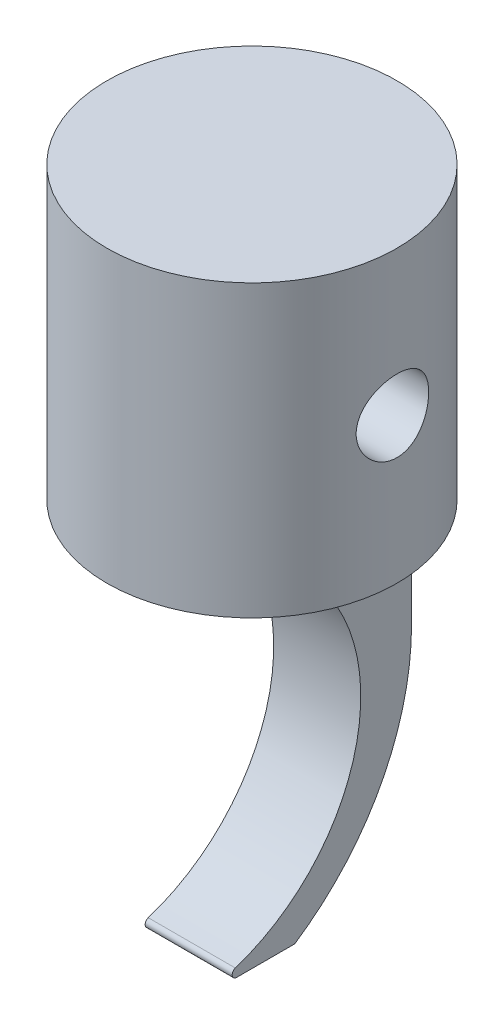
ISO-10303-21;
HEADER;
FILE_DESCRIPTION(('STEP AP214'),'2;1');
FILE_NAME('part.step','',(''),(''),'','','');
FILE_SCHEMA(('AUTOMOTIVE_DESIGN { 1 0 10303 214 1 1 1 1 }'));
ENDSEC;
DATA;
#1=APPLICATION_CONTEXT('core data for automotive mechanical design processes');
#2=APPLICATION_PROTOCOL_DEFINITION('international standard','automotive_design',2000,#1);
#3=PRODUCT_CONTEXT('',#1,'mechanical');
#4=PRODUCT('Part','Part','',(#3));
#5=PRODUCT_RELATED_PRODUCT_CATEGORY('part','',(#4));
#6=PRODUCT_DEFINITION_FORMATION('','',#4);
#7=PRODUCT_DEFINITION_CONTEXT('part definition',#1,'design');
#8=PRODUCT_DEFINITION('design','',#6,#7);
#9=PRODUCT_DEFINITION_SHAPE('','',#8);
#10=(LENGTH_UNIT() NAMED_UNIT(*) SI_UNIT(.MILLI.,.METRE.));
#11=(NAMED_UNIT(*) PLANE_ANGLE_UNIT() SI_UNIT($,.RADIAN.));
#12=(NAMED_UNIT(*) SI_UNIT($,.STERADIAN.) SOLID_ANGLE_UNIT());
#13=UNCERTAINTY_MEASURE_WITH_UNIT(LENGTH_MEASURE(1.E-05),#10,'distance_accuracy_value','');
#14=(GEOMETRIC_REPRESENTATION_CONTEXT(3) GLOBAL_UNCERTAINTY_ASSIGNED_CONTEXT((#13)) GLOBAL_UNIT_ASSIGNED_CONTEXT((#10,
#11,#12)) REPRESENTATION_CONTEXT('',''));
#15=CARTESIAN_POINT('',(0.,0.,0.));
#16=DIRECTION('',(0.,0.,1.));
#17=DIRECTION('',(1.,0.,0.));
#18=AXIS2_PLACEMENT_3D('',#15,#16,#17);
#19=CARTESIAN_POINT('',(0.,20.,0.));
#20=DIRECTION('',(0.,-1.,0.));
#21=DIRECTION('',(0.,0.,-1.));
#22=AXIS2_PLACEMENT_3D('',#19,#20,#21);
#23=CYLINDRICAL_SURFACE('',#22,10.);
#24=CARTESIAN_POINT('',(-10.,7.5,0.));
#25=CARTESIAN_POINT('',(-9.99999766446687,7.50000387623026,-0.138126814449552));
#26=CARTESIAN_POINT('',(-9.99710963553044,7.51148591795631,-0.276296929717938));
#27=CARTESIAN_POINT('',(-9.98586856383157,7.55704191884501,-0.548677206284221));
#28=CARTESIAN_POINT('',(-9.97751242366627,7.59112868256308,-0.682885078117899));
#29=CARTESIAN_POINT('',(-9.9562604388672,7.68073208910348,-0.943368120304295));
#30=CARTESIAN_POINT('',(-9.94337004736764,7.73622299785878,-1.06965260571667));
#31=CARTESIAN_POINT('',(-9.91442239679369,7.86696898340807,-1.31112021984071));
#32=CARTESIAN_POINT('',(-9.89836503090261,7.94222472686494,-1.42630297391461));
#33=CARTESIAN_POINT('',(-9.86445689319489,8.1120013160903,-1.64466987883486));
#34=CARTESIAN_POINT('',(-9.84657845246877,8.20685262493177,-1.74759281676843));
#35=CARTESIAN_POINT('',(-9.8112270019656,8.41242034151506,-1.93624821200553));
#36=CARTESIAN_POINT('',(-9.79375403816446,8.52313853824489,-2.02197872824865));
#37=CARTESIAN_POINT('',(-9.76091292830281,8.75932537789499,-2.17504423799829));
#38=CARTESIAN_POINT('',(-9.74557990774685,8.88498871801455,-2.2420870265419));
#39=CARTESIAN_POINT('',(-9.71915824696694,9.14624735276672,-2.35399484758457));
#40=CARTESIAN_POINT('',(-9.70806892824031,9.28184105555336,-2.39886342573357));
#41=CARTESIAN_POINT('',(-9.69167461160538,9.55623916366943,-2.46425806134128));
#42=CARTESIAN_POINT('',(-9.68625818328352,9.69492482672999,-2.48525378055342));
#43=CARTESIAN_POINT('',(-9.68148937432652,9.97394761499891,-2.50376962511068));
#44=CARTESIAN_POINT('',(-9.68213600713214,10.1142844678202,-2.50129356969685));
#45=CARTESIAN_POINT('',(-9.68932009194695,10.3890263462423,-2.47331087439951));
#46=CARTESIAN_POINT('',(-9.69571438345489,10.5234927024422,-2.44836390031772));
#47=CARTESIAN_POINT('',(-9.71344516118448,10.7862684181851,-2.37704031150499));
#48=CARTESIAN_POINT('',(-9.72478199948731,10.9145773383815,-2.33066217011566));
#49=CARTESIAN_POINT('',(-9.75125189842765,11.1628966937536,-2.21731579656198));
#50=CARTESIAN_POINT('',(-9.76642212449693,11.282810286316,-2.1501444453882));
#51=CARTESIAN_POINT('',(-9.79882851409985,11.5098645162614,-1.99726046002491));
#52=CARTESIAN_POINT('',(-9.81606503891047,11.6170029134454,-1.91154458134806));
#53=CARTESIAN_POINT('',(-9.85126467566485,11.818672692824,-1.72110570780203));
#54=CARTESIAN_POINT('',(-9.86923449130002,11.9127574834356,-1.61591043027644));
#55=CARTESIAN_POINT('',(-9.90343275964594,12.0820354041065,-1.39101986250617));
#56=CARTESIAN_POINT('',(-9.91966115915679,12.1572279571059,-1.27132412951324));
#57=CARTESIAN_POINT('',(-9.94862886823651,12.2867509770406,-1.02019314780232));
#58=CARTESIAN_POINT('',(-9.96135600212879,12.341008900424,-0.888718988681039));
#59=CARTESIAN_POINT('',(-9.98179861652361,12.4265288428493,-0.618126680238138));
#60=CARTESIAN_POINT('',(-9.98951505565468,12.4577952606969,-0.479009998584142));
#61=CARTESIAN_POINT('',(-9.99892498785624,12.4957626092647,-0.200899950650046));
#62=CARTESIAN_POINT('',(-10.0007675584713,12.5030717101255,-0.0619945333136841));
#63=CARTESIAN_POINT('',(-9.99864674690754,12.4945849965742,0.215054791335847));
#64=CARTESIAN_POINT('',(-9.99468388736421,12.4787912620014,0.353198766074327));
#65=CARTESIAN_POINT('',(-9.98149301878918,12.4250484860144,0.622690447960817));
#66=CARTESIAN_POINT('',(-9.97234390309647,12.3874312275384,0.754108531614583));
#67=CARTESIAN_POINT('',(-9.94981177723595,12.2914881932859,1.00876215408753));
#68=CARTESIAN_POINT('',(-9.93642833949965,12.2331603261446,1.13199686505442));
#69=CARTESIAN_POINT('',(-9.9065551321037,12.0962731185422,1.36920522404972));
#70=CARTESIAN_POINT('',(-9.89001445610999,12.0173731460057,1.48297573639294));
#71=CARTESIAN_POINT('',(-9.85574181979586,11.8420168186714,1.69587768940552));
#72=CARTESIAN_POINT('',(-9.83800965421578,11.7455574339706,1.79500659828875));
#73=CARTESIAN_POINT('',(-9.80281594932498,11.5349967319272,1.97831761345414));
#74=CARTESIAN_POINT('',(-9.78537173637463,11.4205204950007,2.06207311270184));
#75=CARTESIAN_POINT('',(-9.75321463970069,11.1787789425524,2.20918459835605));
#76=CARTESIAN_POINT('',(-9.73850163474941,11.0515141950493,2.27254149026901));
#77=CARTESIAN_POINT('',(-9.71363491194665,10.7884904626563,2.37658570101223));
#78=CARTESIAN_POINT('',(-9.70345425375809,10.6527872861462,2.41740732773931));
#79=CARTESIAN_POINT('',(-9.68877906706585,10.3761506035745,2.47557609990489));
#80=CARTESIAN_POINT('',(-9.68428329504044,10.2352182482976,2.49292837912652));
#81=CARTESIAN_POINT('',(-9.68158168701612,9.95646496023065,2.50339765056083));
#82=CARTESIAN_POINT('',(-9.68319887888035,9.81867094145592,2.49719649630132));
#83=CARTESIAN_POINT('',(-9.69213181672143,9.54616018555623,2.46229546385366));
#84=CARTESIAN_POINT('',(-9.69944744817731,9.41144338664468,2.43359603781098));
#85=CARTESIAN_POINT('',(-9.71885434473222,9.14965256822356,2.35488553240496));
#86=CARTESIAN_POINT('',(-9.73091692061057,9.02253782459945,2.30500234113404));
#87=CARTESIAN_POINT('',(-9.7584625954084,8.77839102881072,2.18544152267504));
#88=CARTESIAN_POINT('',(-9.77394616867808,8.66136037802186,2.11576115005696));
#89=CARTESIAN_POINT('',(-9.80709390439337,8.43740895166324,1.95644624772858));
#90=CARTESIAN_POINT('',(-9.82480441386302,8.33083154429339,1.86633860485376));
#91=CARTESIAN_POINT('',(-9.86013378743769,8.13408825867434,1.66964895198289));
#92=CARTESIAN_POINT('',(-9.87775262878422,8.04392628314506,1.56306303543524));
#93=CARTESIAN_POINT('',(-9.9112942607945,7.88098115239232,1.33411264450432));
#94=CARTESIAN_POINT('',(-9.92718055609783,7.80854231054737,1.21149737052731));
#95=CARTESIAN_POINT('',(-9.95508208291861,7.68542089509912,0.95544343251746));
#96=CARTESIAN_POINT('',(-9.96710008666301,7.63472273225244,0.8220126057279));
#97=CARTESIAN_POINT('',(-9.98413432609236,7.56404694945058,0.574017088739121));
#98=CARTESIAN_POINT('',(-9.99004308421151,7.54008126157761,0.460633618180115));
#99=CARTESIAN_POINT('',(-9.9979767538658,7.5080567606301,0.231510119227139));
#100=CARTESIAN_POINT('',(-10.0000019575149,7.49999675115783,0.115770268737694));
#101=CARTESIAN_POINT('',(-10.,7.5,0.));
#102=B_SPLINE_CURVE_WITH_KNOTS('',3,(#24,#25,#26,#27,#28,#29,#30,#31,#32,#33,#34,#35,#36,#37,
#38,#39,#40,#41,#42,#43,#44,#45,#46,#47,#48,#49,#50,#51,#52,#53,#54,#55,#56,#57,#58,#59,#60,#61,
#62,#63,#64,#65,#66,#67,#68,#69,#70,#71,#72,#73,#74,#75,#76,#77,#78,#79,#80,#81,#82,#83,#84,#85,
#86,#87,#88,#89,#90,#91,#92,#93,#94,#95,#96,#97,#98,#99,#100,#101),.UNSPECIFIED.,.T.,.F.,(4,2,2,
2,2,2,2,2,2,2,2,2,2,2,2,2,2,2,2,2,2,2,2,2,2,2,2,2,2,2,2,2,2,2,2,2,2,2,4),(0.,0.413956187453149,
0.828147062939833,1.24184150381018,1.65554990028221,2.07690725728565,2.4983121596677,
2.92597745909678,3.35357435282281,3.77260491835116,4.19156730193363,4.60037495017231,
5.00921172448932,5.42217546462,5.83521151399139,6.26002501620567,6.6848514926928,
7.11113715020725,7.53734122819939,7.95263848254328,8.36789835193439,8.7770045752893,
9.18615212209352,9.60255979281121,10.0190393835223,10.4457418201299,10.8724253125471,
11.2965375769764,11.7205570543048,12.1323963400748,12.5442273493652,12.9536066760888,
13.3630428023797,13.7831596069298,14.2033761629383,14.6312030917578,15.0587227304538,
15.4057040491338,15.752659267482),.UNSPECIFIED.);
#103=CARTESIAN_POINT('',(-10.,7.5,0.));
#104=VERTEX_POINT('',#103);
#105=EDGE_CURVE('E11',#104,#104,#102,.T.);
#106=ORIENTED_EDGE('',*,*,#105,.T.);
#107=EDGE_LOOP('',(#106));
#108=FACE_BOUND('',#107,.T.);
#109=CARTESIAN_POINT('',(9.68245836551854,10.,-2.5));
#110=CARTESIAN_POINT('',(9.6824610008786,9.86194924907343,-2.49999607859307));
#111=CARTESIAN_POINT('',(9.68544306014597,9.72385510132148,-2.48852624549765));
#112=CARTESIAN_POINT('',(9.69701861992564,9.45163242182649,-2.44302312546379));
#113=CARTESIAN_POINT('',(9.7056153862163,9.31750624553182,-2.40897670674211));
#114=CARTESIAN_POINT('',(9.7273872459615,9.05719646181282,-2.31949119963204));
#115=CARTESIAN_POINT('',(9.74055642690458,8.93100284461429,-2.26407972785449));
#116=CARTESIAN_POINT('',(9.76998192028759,8.68968914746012,-2.13352114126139));
#117=CARTESIAN_POINT('',(9.78623836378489,8.57456953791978,-2.05837318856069));
#118=CARTESIAN_POINT('',(9.82040716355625,8.35613835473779,-1.88870842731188));
#119=CARTESIAN_POINT('',(9.83834597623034,8.25310639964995,-1.79383688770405));
#120=CARTESIAN_POINT('',(9.87362875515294,8.06423860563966,-1.58818206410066));
#121=CARTESIAN_POINT('',(9.89097266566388,7.97840437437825,-1.47739729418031));
#122=CARTESIAN_POINT('',(9.92340415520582,7.82522453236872,-1.24114520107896));
#123=CARTESIAN_POINT('',(9.93845687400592,7.75815361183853,-1.11549457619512));
#124=CARTESIAN_POINT('',(9.96430811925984,7.64619035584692,-0.854263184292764));
#125=CARTESIAN_POINT('',(9.97510727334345,7.60129474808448,-0.718683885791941));
#126=CARTESIAN_POINT('',(9.9910475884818,7.53585216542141,-0.444358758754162));
#127=CARTESIAN_POINT('',(9.99629893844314,7.51483035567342,-0.305732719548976));
#128=CARTESIAN_POINT('',(10.000935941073,7.49624162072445,-0.02682881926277));
#129=CARTESIAN_POINT('',(10.000322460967,7.4986712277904,0.113448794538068));
#130=CARTESIAN_POINT('',(9.99338094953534,7.52657485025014,0.388380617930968));
#131=CARTESIAN_POINT('',(9.98718002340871,7.55153632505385,0.523090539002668));
#132=CARTESIAN_POINT('',(9.96990836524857,7.6229712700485,0.786345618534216));
#133=CARTESIAN_POINT('',(9.95883737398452,7.66944588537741,0.914890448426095));
#134=CARTESIAN_POINT('',(9.93287509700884,7.78300257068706,1.16351675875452));
#135=CARTESIAN_POINT('',(9.91795019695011,7.85026704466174,1.28351127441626));
#136=CARTESIAN_POINT('',(9.88589903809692,8.00335567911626,1.51068905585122));
#137=CARTESIAN_POINT('',(9.8687723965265,8.08918306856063,1.61787008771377));
#138=CARTESIAN_POINT('',(9.83363713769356,8.27970874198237,1.81943508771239));
#139=CARTESIAN_POINT('',(9.81561719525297,8.38485489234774,1.91339419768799));
#140=CARTESIAN_POINT('',(9.78115043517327,8.60959997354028,2.08244093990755));
#141=CARTESIAN_POINT('',(9.76470369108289,8.72919957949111,2.15752769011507));
#142=CARTESIAN_POINT('',(9.73520496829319,8.98029003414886,2.28697032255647));
#143=CARTESIAN_POINT('',(9.72216983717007,9.1118357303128,2.34122391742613));
#144=CARTESIAN_POINT('',(9.70118640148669,9.38258546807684,2.42671405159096));
#145=CARTESIAN_POINT('',(9.69323700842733,9.5217878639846,2.45795551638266));
#146=CARTESIAN_POINT('',(9.68355356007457,9.79995950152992,2.49582963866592));
#147=CARTESIAN_POINT('',(9.68166088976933,9.93883779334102,2.50309047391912));
#148=CARTESIAN_POINT('',(9.68387343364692,10.2158219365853,2.49451699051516));
#149=CARTESIAN_POINT('',(9.687978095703,10.3539278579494,2.4786847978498));
#150=CARTESIAN_POINT('',(9.70157081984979,10.6231142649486,2.42492546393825));
#151=CARTESIAN_POINT('',(9.71096970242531,10.7542727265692,2.3873640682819));
#152=CARTESIAN_POINT('',(9.73400718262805,11.0084314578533,2.29161808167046));
#153=CARTESIAN_POINT('',(9.74764628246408,11.1314307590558,2.2334310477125));
#154=CARTESIAN_POINT('',(9.77796137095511,11.3684412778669,2.0967706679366));
#155=CARTESIAN_POINT('',(9.79469168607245,11.482228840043,2.01792175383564));
#156=CARTESIAN_POINT('',(9.82917083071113,11.6951883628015,1.84265073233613));
#157=CARTESIAN_POINT('',(9.84691982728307,11.7943579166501,1.7462257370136));
#158=CARTESIAN_POINT('',(9.88197403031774,11.9778110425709,1.53565680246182));
#159=CARTESIAN_POINT('',(9.8992570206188,12.0616600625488,1.42112988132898));
#160=CARTESIAN_POINT('',(9.93097216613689,12.2089358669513,1.17925670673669));
#161=CARTESIAN_POINT('',(9.94540447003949,12.2723637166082,1.05191112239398));
#162=CARTESIAN_POINT('',(9.96970115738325,12.3764460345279,0.788895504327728));
#163=CARTESIAN_POINT('',(9.97959830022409,12.4172642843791,0.653293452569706));
#164=CARTESIAN_POINT('',(9.99385293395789,12.4754603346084,0.376874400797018));
#165=CARTESIAN_POINT('',(9.99821149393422,12.492842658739,0.236058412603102));
#166=CARTESIAN_POINT('',(10.0008542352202,12.5034189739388,-0.0427088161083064));
#167=CARTESIAN_POINT('',(9.99929947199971,12.4972542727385,-0.180634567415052));
#168=CARTESIAN_POINT('',(9.99064741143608,12.4623804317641,-0.453418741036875));
#169=CARTESIAN_POINT('',(9.98355027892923,12.4336719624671,-0.58827725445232));
#170=CARTESIAN_POINT('',(9.96463582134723,12.3548694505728,-0.850427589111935));
#171=CARTESIAN_POINT('',(9.95284411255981,12.3048913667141,-0.977756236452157));
#172=CARTESIAN_POINT('',(9.92578222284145,12.1850735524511,-1.22229263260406));
#173=CARTESIAN_POINT('',(9.91051160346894,12.1152313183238,-1.33949910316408));
#174=CARTESIAN_POINT('',(9.87768124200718,11.9557119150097,-1.56350482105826));
#175=CARTESIAN_POINT('',(9.86007542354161,11.8655996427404,-1.66998747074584));
#176=CARTESIAN_POINT('',(9.82476622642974,11.6689428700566,-1.86653755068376));
#177=CARTESIAN_POINT('',(9.80706282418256,11.5623942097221,-1.95660081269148));
#178=CARTESIAN_POINT('',(9.77318689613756,11.3334964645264,-2.11940506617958));
#179=CARTESIAN_POINT('',(9.75704909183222,11.2108896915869,-2.19179154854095));
#180=CARTESIAN_POINT('',(9.7285988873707,10.954861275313,-2.31481724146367));
#181=CARTESIAN_POINT('',(9.71628370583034,10.8214475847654,-2.36547227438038));
#182=CARTESIAN_POINT('',(9.69879771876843,10.5735574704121,-2.43605632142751));
#183=CARTESIAN_POINT('',(9.69271657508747,10.4602670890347,-2.4599829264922));
#184=CARTESIAN_POINT('',(9.6845459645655,10.2313278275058,-2.49195573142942));
#185=CARTESIAN_POINT('',(9.6824561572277,10.115679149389,-2.50000328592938));
#186=CARTESIAN_POINT('',(9.68245836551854,10.,-2.5));
#187=B_SPLINE_CURVE_WITH_KNOTS('',3,(#109,#110,#111,#112,#113,#114,#115,#116,#117,#118,#119,
#120,#121,#122,#123,#124,#125,#126,#127,#128,#129,#130,#131,#132,#133,#134,#135,#136,#137,#138,
#139,#140,#141,#142,#143,#144,#145,#146,#147,#148,#149,#150,#151,#152,#153,#154,#155,#156,#157,
#158,#159,#160,#161,#162,#163,#164,#165,#166,#167,#168,#169,#170,#171,#172,#173,#174,#175,#176,
#177,#178,#179,#180,#181,#182,#183,#184,#185,#186),.UNSPECIFIED.,.T.,.F.,(4,2,2,2,2,2,2,2,2,2,2,
2,2,2,2,2,2,2,2,2,2,2,2,2,2,2,2,2,2,2,2,2,2,2,2,2,2,2,4),(0.,0.413727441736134,
0.827695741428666,1.24113072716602,1.65458326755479,2.07623954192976,2.49793521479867,
2.9255149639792,3.35303159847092,3.77188750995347,4.19068148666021,4.60018262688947,
5.00970556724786,5.42292874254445,5.83622385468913,6.26070466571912,6.68520531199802,
7.11176432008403,7.53823200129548,7.95343574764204,8.36860127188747,8.77697405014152,
9.18539521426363,9.60182845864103,10.0183301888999,10.4452533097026,10.872154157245,
11.2959207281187,11.7196054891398,12.131834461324,12.5440511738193,12.9540487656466,
13.3640980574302,13.7839709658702,14.2039503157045,14.6317647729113,15.0592672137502,
15.4059782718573,15.7526597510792),.UNSPECIFIED.);
#188=CARTESIAN_POINT('',(9.68245836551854,10.,-2.5));
#189=VERTEX_POINT('',#188);
#190=EDGE_CURVE('E60',#189,#189,#187,.T.);
#191=ORIENTED_EDGE('',*,*,#190,.T.);
#192=EDGE_LOOP('',(#191));
#193=FACE_BOUND('',#192,.T.);
#194=CARTESIAN_POINT('',(0.,20.,0.));
#195=DIRECTION('',(0.,1.,0.));
#196=DIRECTION('',(0.,0.,1.));
#197=AXIS2_PLACEMENT_3D('',#194,#195,#196);
#198=CIRCLE('',#197,10.);
#199=CARTESIAN_POINT('',(0.,20.,10.));
#200=VERTEX_POINT('',#199);
#201=EDGE_CURVE('E177',#200,#200,#198,.T.);
#202=ORIENTED_EDGE('',*,*,#201,.F.);
#203=EDGE_LOOP('',(#202));
#204=FACE_BOUND('',#203,.T.);
#205=CARTESIAN_POINT('',(0.,0.,0.));
#206=DIRECTION('',(0.,1.,0.));
#207=DIRECTION('',(0.,0.,1.));
#208=AXIS2_PLACEMENT_3D('',#205,#206,#207);
#209=CIRCLE('',#208,10.);
#210=CARTESIAN_POINT('',(0.,0.,10.));
#211=VERTEX_POINT('',#210);
#212=EDGE_CURVE('E166',#211,#211,#209,.T.);
#213=ORIENTED_EDGE('',*,*,#212,.T.);
#214=EDGE_LOOP('',(#213));
#215=FACE_BOUND('',#214,.T.);
#216=ADVANCED_FACE('F47',(#108,#193,#204,#215),#23,.T.);
#217=CARTESIAN_POINT('',(0.,20.,0.));
#218=DIRECTION('',(0.,1.,0.));
#219=DIRECTION('',(0.,0.,1.));
#220=AXIS2_PLACEMENT_3D('',#217,#218,#219);
#221=PLANE('',#220);
#222=ORIENTED_EDGE('',*,*,#201,.T.);
#223=EDGE_LOOP('',(#222));
#224=FACE_BOUND('',#223,.T.);
#225=ADVANCED_FACE('F217',(#224),#221,.T.);
#226=CARTESIAN_POINT('',(0.,0.,0.));
#227=DIRECTION('',(0.,1.,0.));
#228=DIRECTION('',(0.,0.,1.));
#229=AXIS2_PLACEMENT_3D('',#226,#227,#228);
#230=PLANE('',#229);
#231=DIRECTION('',(1.,0.,0.));
#232=VECTOR('',#231,1.);
#233=CARTESIAN_POINT('',(-3.,0.,-8.));
#234=LINE('',#233,#232);
#235=CARTESIAN_POINT('',(-3.,0.,-8.));
#236=VERTEX_POINT('',#235);
#237=CARTESIAN_POINT('',(3.,0.,-8.));
#238=VERTEX_POINT('',#237);
#239=EDGE_CURVE('E72',#236,#238,#234,.T.);
#240=ORIENTED_EDGE('',*,*,#239,.F.);
#241=DIRECTION('',(0.,0.,1.));
#242=VECTOR('',#241,1.);
#243=CARTESIAN_POINT('',(-3.,0.,8.));
#244=LINE('',#243,#242);
#245=CARTESIAN_POINT('',(-3.,0.,8.));
#246=VERTEX_POINT('',#245);
#247=EDGE_CURVE('E67',#236,#246,#244,.T.);
#248=ORIENTED_EDGE('',*,*,#247,.T.);
#249=DIRECTION('',(1.,0.,0.));
#250=VECTOR('',#249,1.);
#251=CARTESIAN_POINT('',(-3.,0.,8.));
#252=LINE('',#251,#250);
#253=CARTESIAN_POINT('',(3.,0.,8.));
#254=VERTEX_POINT('',#253);
#255=EDGE_CURVE('E163',#246,#254,#252,.T.);
#256=ORIENTED_EDGE('',*,*,#255,.T.);
#257=DIRECTION('',(0.,0.,1.));
#258=VECTOR('',#257,1.);
#259=CARTESIAN_POINT('',(3.,0.,8.));
#260=LINE('',#259,#258);
#261=EDGE_CURVE('E129',#238,#254,#260,.T.);
#262=ORIENTED_EDGE('',*,*,#261,.F.);
#263=EDGE_LOOP('',(#240,#248,#256,#262));
#264=FACE_BOUND('',#263,.T.);
#265=ORIENTED_EDGE('',*,*,#212,.F.);
#266=EDGE_LOOP('',(#265));
#267=FACE_BOUND('',#266,.T.);
#268=ADVANCED_FACE('F216',(#264,#267),#230,.F.);
#269=CARTESIAN_POINT('',(-3.,-12.5,8.));
#270=DIRECTION('',(1.,0.,0.));
#271=DIRECTION('',(0.,0.,-1.));
#272=AXIS2_PLACEMENT_3D('',#269,#270,#271);
#273=CYLINDRICAL_SURFACE('',#272,12.5);
#274=DIRECTION('',(1.,0.,0.));
#275=VECTOR('',#274,1.);
#276=CARTESIAN_POINT('',(-3.,-24.3911383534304,4.14632270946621));
#277=LINE('',#276,#275);
#278=CARTESIAN_POINT('',(-3.,-24.3911383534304,4.14632270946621));
#279=VERTEX_POINT('',#278);
#280=CARTESIAN_POINT('',(3.,-24.3911383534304,4.14632270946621));
#281=VERTEX_POINT('',#280);
#282=EDGE_CURVE('E104',#279,#281,#277,.T.);
#283=ORIENTED_EDGE('',*,*,#282,.T.);
#284=CARTESIAN_POINT('',(3.,-12.5,8.));
#285=DIRECTION('',(-1.,0.,0.));
#286=DIRECTION('',(0.,0.,1.));
#287=AXIS2_PLACEMENT_3D('',#284,#285,#286);
#288=CIRCLE('',#287,12.5);
#289=EDGE_CURVE('E108',#254,#281,#288,.T.);
#290=ORIENTED_EDGE('',*,*,#289,.F.);
#291=ORIENTED_EDGE('',*,*,#255,.F.);
#292=CARTESIAN_POINT('',(-3.,-12.5,8.));
#293=DIRECTION('',(-1.,0.,0.));
#294=DIRECTION('',(0.,0.,1.));
#295=AXIS2_PLACEMENT_3D('',#292,#293,#294);
#296=CIRCLE('',#295,12.5);
#297=EDGE_CURVE('E110',#246,#279,#296,.T.);
#298=ORIENTED_EDGE('',*,*,#297,.T.);
#299=EDGE_LOOP('',(#283,#290,#291,#298));
#300=FACE_BOUND('',#299,.T.);
#301=ADVANCED_FACE('F106',(#300),#273,.F.);
#302=CARTESIAN_POINT('',(-3.,0.,-8.));
#303=DIRECTION('',(0.,0.,-1.));
#304=DIRECTION('',(-1.,0.,0.));
#305=AXIS2_PLACEMENT_3D('',#302,#303,#304);
#306=PLANE('',#305);
#307=ORIENTED_EDGE('',*,*,#239,.T.);
#308=DIRECTION('',(0.,1.,0.));
#309=VECTOR('',#308,1.);
#310=CARTESIAN_POINT('',(3.,0.,-8.));
#311=LINE('',#310,#309);
#312=CARTESIAN_POINT('',(3.,-10.,-8.));
#313=VERTEX_POINT('',#312);
#314=EDGE_CURVE('E140',#313,#238,#311,.T.);
#315=ORIENTED_EDGE('',*,*,#314,.F.);
#316=DIRECTION('',(1.,0.,0.));
#317=VECTOR('',#316,1.);
#318=CARTESIAN_POINT('',(-3.,-10.,-8.));
#319=LINE('',#318,#317);
#320=CARTESIAN_POINT('',(-3.,-10.,-8.));
#321=VERTEX_POINT('',#320);
#322=EDGE_CURVE('E169',#321,#313,#319,.T.);
#323=ORIENTED_EDGE('',*,*,#322,.F.);
#324=DIRECTION('',(0.,1.,0.));
#325=VECTOR('',#324,1.);
#326=CARTESIAN_POINT('',(-3.,0.,-8.));
#327=LINE('',#326,#325);
#328=EDGE_CURVE('E158',#321,#236,#327,.T.);
#329=ORIENTED_EDGE('',*,*,#328,.T.);
#330=EDGE_LOOP('',(#307,#315,#323,#329));
#331=FACE_BOUND('',#330,.T.);
#332=ADVANCED_FACE('F200',(#331),#306,.T.);
#333=CARTESIAN_POINT('',(-3.,-10.,10.));
#334=DIRECTION('',(1.,0.,0.));
#335=DIRECTION('',(0.,0.,-1.));
#336=AXIS2_PLACEMENT_3D('',#333,#334,#335);
#337=CYLINDRICAL_SURFACE('',#336,18.);
#338=ORIENTED_EDGE('',*,*,#322,.T.);
#339=CARTESIAN_POINT('',(3.,-10.,10.));
#340=DIRECTION('',(1.,0.,0.));
#341=DIRECTION('',(0.,0.,1.));
#342=AXIS2_PLACEMENT_3D('',#339,#340,#341);
#343=CIRCLE('',#342,18.);
#344=CARTESIAN_POINT('',(3.,-25.,0.0501256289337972));
#345=VERTEX_POINT('',#344);
#346=EDGE_CURVE('E136',#345,#313,#343,.T.);
#347=ORIENTED_EDGE('',*,*,#346,.F.);
#348=DIRECTION('',(1.,0.,0.));
#349=VECTOR('',#348,1.);
#350=CARTESIAN_POINT('',(-3.,-25.,0.0501256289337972));
#351=LINE('',#350,#349);
#352=CARTESIAN_POINT('',(-3.,-25.,0.0501256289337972));
#353=VERTEX_POINT('',#352);
#354=EDGE_CURVE('E172',#353,#345,#351,.T.);
#355=ORIENTED_EDGE('',*,*,#354,.F.);
#356=CARTESIAN_POINT('',(-3.,-10.,10.));
#357=DIRECTION('',(1.,0.,0.));
#358=DIRECTION('',(0.,0.,1.));
#359=AXIS2_PLACEMENT_3D('',#356,#357,#358);
#360=CIRCLE('',#359,18.);
#361=EDGE_CURVE('E154',#353,#321,#360,.T.);
#362=ORIENTED_EDGE('',*,*,#361,.T.);
#363=EDGE_LOOP('',(#338,#347,#355,#362));
#364=FACE_BOUND('',#363,.T.);
#365=ADVANCED_FACE('F203',(#364),#337,.T.);
#366=CARTESIAN_POINT('',(-3.,-25.,4.0501256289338));
#367=DIRECTION('',(0.,-1.,0.));
#368=DIRECTION('',(0.,0.,-1.));
#369=AXIS2_PLACEMENT_3D('',#366,#367,#368);
#370=PLANE('',#369);
#371=ORIENTED_EDGE('',*,*,#354,.T.);
#372=DIRECTION('',(0.,0.,-1.));
#373=VECTOR('',#372,1.);
#374=CARTESIAN_POINT('',(3.,-25.,4.0501256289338));
#375=LINE('',#374,#373);
#376=CARTESIAN_POINT('',(3.,-25.,4.0501256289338));
#377=VERTEX_POINT('',#376);
#378=EDGE_CURVE('E124',#377,#345,#375,.T.);
#379=ORIENTED_EDGE('',*,*,#378,.F.);
#380=DIRECTION('',(1.,0.,0.));
#381=VECTOR('',#380,1.);
#382=CARTESIAN_POINT('',(-3.,-25.,4.0501256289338));
#383=LINE('',#382,#381);
#384=CARTESIAN_POINT('',(-3.,-25.,4.0501256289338));
#385=VERTEX_POINT('',#384);
#386=EDGE_CURVE('E115',#385,#377,#383,.T.);
#387=ORIENTED_EDGE('',*,*,#386,.F.);
#388=DIRECTION('',(0.,0.,-1.));
#389=VECTOR('',#388,1.);
#390=CARTESIAN_POINT('',(-3.,-25.,4.0501256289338));
#391=LINE('',#390,#389);
#392=EDGE_CURVE('E150',#385,#353,#391,.T.);
#393=ORIENTED_EDGE('',*,*,#392,.T.);
#394=EDGE_LOOP('',(#371,#379,#387,#393));
#395=FACE_BOUND('',#394,.T.);
#396=ADVANCED_FACE('F207',(#395),#370,.T.);
#397=CARTESIAN_POINT('',(-3.,-24.6879698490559,4.0501256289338));
#398=DIRECTION('',(1.,0.,0.));
#399=DIRECTION('',(0.,0.,-1.));
#400=AXIS2_PLACEMENT_3D('',#397,#398,#399);
#401=CYLINDRICAL_SURFACE('',#400,0.312030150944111);
#402=ORIENTED_EDGE('',*,*,#386,.T.);
#403=CARTESIAN_POINT('',(3.,-24.6879698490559,4.0501256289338));
#404=DIRECTION('',(1.,0.,0.));
#405=DIRECTION('',(0.,0.,1.));
#406=AXIS2_PLACEMENT_3D('',#403,#404,#405);
#407=CIRCLE('',#406,0.312030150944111);
#408=EDGE_CURVE('E118',#281,#377,#407,.T.);
#409=ORIENTED_EDGE('',*,*,#408,.F.);
#410=ORIENTED_EDGE('',*,*,#282,.F.);
#411=CARTESIAN_POINT('',(-3.,-24.6879698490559,4.0501256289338));
#412=DIRECTION('',(1.,0.,0.));
#413=DIRECTION('',(0.,0.,1.));
#414=AXIS2_PLACEMENT_3D('',#411,#412,#413);
#415=CIRCLE('',#414,0.312030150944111);
#416=EDGE_CURVE('E147',#279,#385,#415,.T.);
#417=ORIENTED_EDGE('',*,*,#416,.T.);
#418=EDGE_LOOP('',(#402,#409,#410,#417));
#419=FACE_BOUND('',#418,.T.);
#420=ADVANCED_FACE('F119',(#419),#401,.T.);
#421=CARTESIAN_POINT('',(-3.,-12.5,8.));
#422=DIRECTION('',(-1.,0.,0.));
#423=DIRECTION('',(0.,0.,1.));
#424=AXIS2_PLACEMENT_3D('',#421,#422,#423);
#425=PLANE('',#424);
#426=ORIENTED_EDGE('',*,*,#297,.F.);
#427=ORIENTED_EDGE('',*,*,#247,.F.);
#428=ORIENTED_EDGE('',*,*,#328,.F.);
#429=ORIENTED_EDGE('',*,*,#361,.F.);
#430=ORIENTED_EDGE('',*,*,#392,.F.);
#431=ORIENTED_EDGE('',*,*,#416,.F.);
#432=EDGE_LOOP('',(#426,#427,#428,#429,#430,#431));
#433=FACE_BOUND('',#432,.T.);
#434=ADVANCED_FACE('F196',(#433),#425,.T.);
#435=CARTESIAN_POINT('',(3.,-12.5,8.));
#436=DIRECTION('',(-1.,0.,0.));
#437=DIRECTION('',(0.,0.,1.));
#438=AXIS2_PLACEMENT_3D('',#435,#436,#437);
#439=PLANE('',#438);
#440=ORIENTED_EDGE('',*,*,#289,.T.);
#441=ORIENTED_EDGE('',*,*,#408,.T.);
#442=ORIENTED_EDGE('',*,*,#378,.T.);
#443=ORIENTED_EDGE('',*,*,#346,.T.);
#444=ORIENTED_EDGE('',*,*,#314,.T.);
#445=ORIENTED_EDGE('',*,*,#261,.T.);
#446=EDGE_LOOP('',(#440,#441,#442,#443,#444,#445));
#447=FACE_BOUND('',#446,.T.);
#448=ADVANCED_FACE('F127',(#447),#439,.F.);
#449=CARTESIAN_POINT('',(-10.,10.,0.));
#450=DIRECTION('',(1.,0.,0.));
#451=DIRECTION('',(0.,0.,-1.));
#452=AXIS2_PLACEMENT_3D('',#449,#450,#451);
#453=CYLINDRICAL_SURFACE('',#452,2.5);
#454=ORIENTED_EDGE('',*,*,#190,.F.);
#455=EDGE_LOOP('',(#454));
#456=FACE_BOUND('',#455,.T.);
#457=ORIENTED_EDGE('',*,*,#105,.F.);
#458=EDGE_LOOP('',(#457));
#459=FACE_BOUND('',#458,.T.);
#460=ADVANCED_FACE('F188',(#456,#459),#453,.F.);
#461=CLOSED_SHELL('',(#216,#225,#268,#301,#332,#365,#396,#420,#434,#448,#460));
#462=MANIFOLD_SOLID_BREP('B2',#461);
#463=ADVANCED_BREP_SHAPE_REPRESENTATION('',(#18,#462),#14);
#464=SHAPE_DEFINITION_REPRESENTATION(#9,#463);
ENDSEC;
END-ISO-10303-21;
